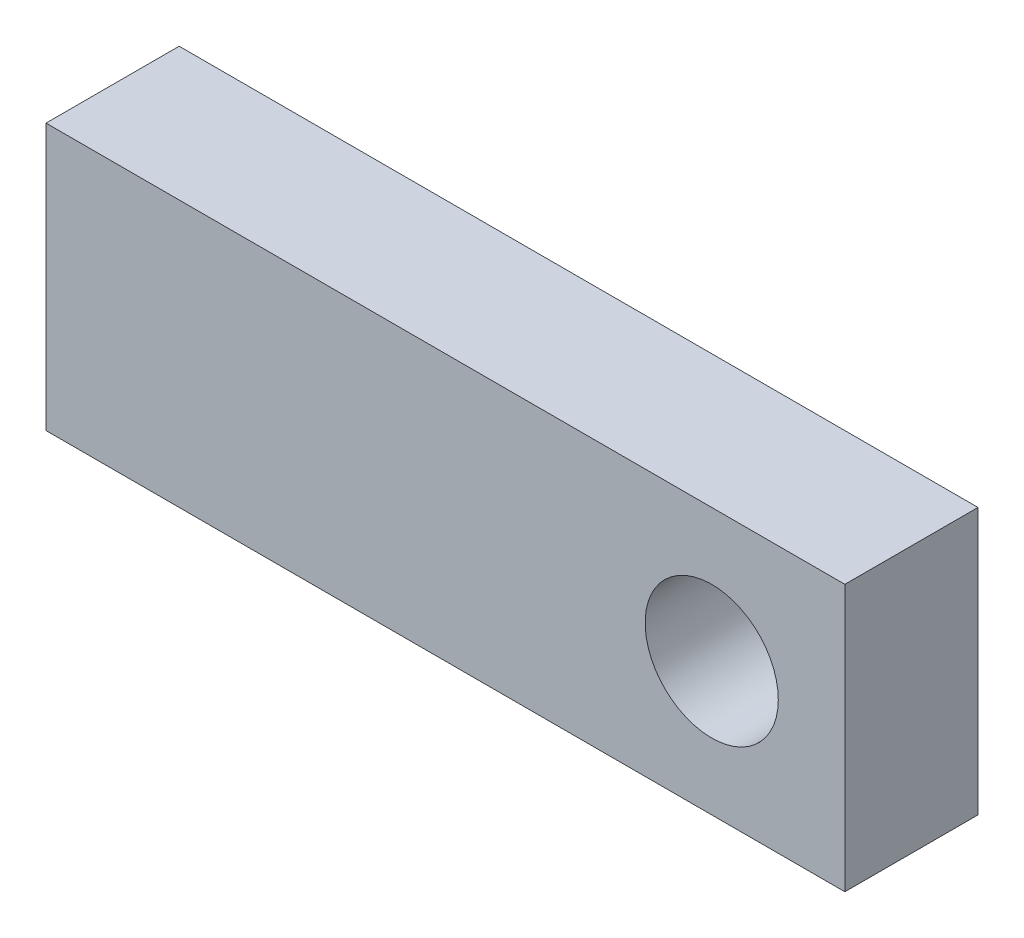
from build123d import *

# Parameters (mm, degrees)
SKETCH1_W      = 76.2
SKETCH1_H      = 25.4
SKETCH1_R      = 6.35
EXTRUDE1_DEPTH = 12.7


with BuildPart() as part:
    # Sketch1 → Extrude1 (new body)
    with BuildSketch(Plane.XY):
        with Locations((10.865660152, 4.490605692)):
            Rectangle(SKETCH1_W, SKETCH1_H)
        with Locations((36.265660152, 4.490605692)):
            Circle(SKETCH1_R, mode=Mode.SUBTRACT)
    extrude(amount=EXTRUDE1_DEPTH)


solid = part.part
